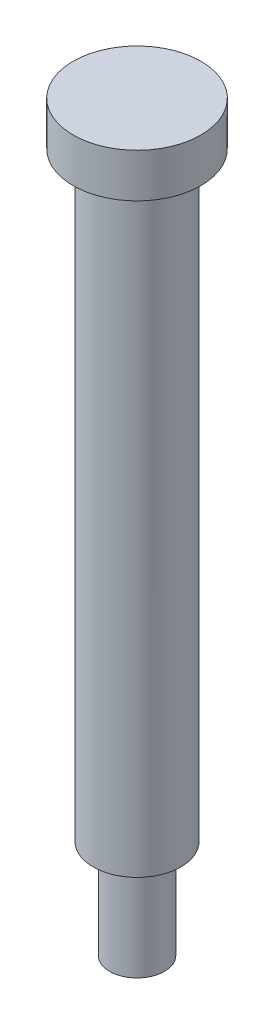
from build123d import *


with BuildPart() as part:
    # Sketch1 → Base-Revolve (revolve)
    with BuildSketch(Plane.XY, mode=Mode.PRIVATE) as base_revolve_sk:
        Polygon((0, 1016.224230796), (0, 801.276730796), (-12.7, 801.276730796), (-12.7, 1003.524230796), (-18.494375, 1003.524230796), (-18.494375, 1016.224230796), align=None)
    revolve(base_revolve_sk.sketch.rotate(Axis((0, 842.551730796, 0), (0, 1, 0)), 270), axis=Axis((0, 842.551730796, 0), (0, 1, 0)))

    # Sketch2 → 5_8-18 UNF-2A (revolve, cut)
    with BuildSketch(Plane.XY):
        with BuildLine():
            Line((-7.9375, 801.276730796), (-12.7, 801.276730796))
            Line((-12.7, 801.276730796), (-12.7, 829.851730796))
            Line((-12.7, 829.851730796), (-7.9375, 829.851730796))
            ThreePointArc((-7.9375, 829.851730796), (-7.38072412, 829.621106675), (-7.1501, 829.064330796))
            Line((-7.1501, 829.064330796), (-7.1501, 828.708730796))
            ThreePointArc((-7.1501, 828.708730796), (-7.38072412, 828.151954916), (-7.9375, 827.921330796))
            Line((-7.9375, 827.921330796), (-7.9375, 801.276730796))
        make_face()
    revolve(axis=Axis((0, 1018.764230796, 0), (0, -1, 0)), mode=Mode.SUBTRACT)


solid = part.part
